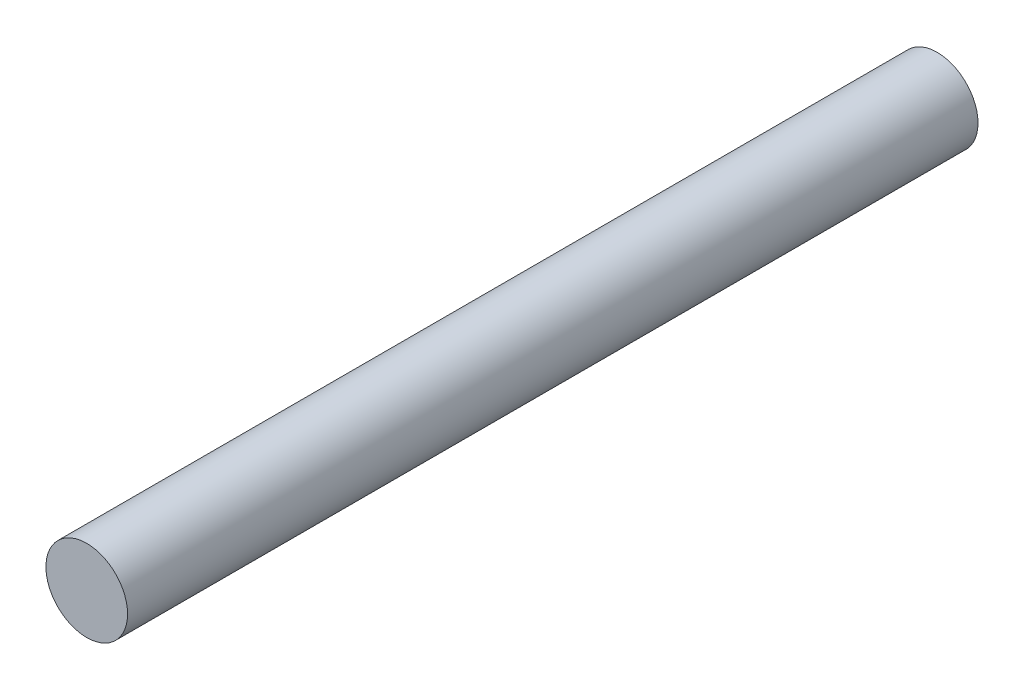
ISO-10303-21;
HEADER;
FILE_DESCRIPTION(('STEP AP214'),'2;1');
FILE_NAME('part.step','',(''),(''),'','','');
FILE_SCHEMA(('AUTOMOTIVE_DESIGN { 1 0 10303 214 1 1 1 1 }'));
ENDSEC;
DATA;
#1=APPLICATION_CONTEXT('core data for automotive mechanical design processes');
#2=APPLICATION_PROTOCOL_DEFINITION('international standard','automotive_design',2000,#1);
#3=PRODUCT_CONTEXT('',#1,'mechanical');
#4=PRODUCT('Part','Part','',(#3));
#5=PRODUCT_RELATED_PRODUCT_CATEGORY('part','',(#4));
#6=PRODUCT_DEFINITION_FORMATION('','',#4);
#7=PRODUCT_DEFINITION_CONTEXT('part definition',#1,'design');
#8=PRODUCT_DEFINITION('design','',#6,#7);
#9=PRODUCT_DEFINITION_SHAPE('','',#8);
#10=(LENGTH_UNIT() NAMED_UNIT(*) SI_UNIT(.MILLI.,.METRE.));
#11=(NAMED_UNIT(*) PLANE_ANGLE_UNIT() SI_UNIT($,.RADIAN.));
#12=(NAMED_UNIT(*) SI_UNIT($,.STERADIAN.) SOLID_ANGLE_UNIT());
#13=UNCERTAINTY_MEASURE_WITH_UNIT(LENGTH_MEASURE(1.E-05),#10,'distance_accuracy_value','');
#14=(GEOMETRIC_REPRESENTATION_CONTEXT(3) GLOBAL_UNCERTAINTY_ASSIGNED_CONTEXT((#13)) GLOBAL_UNIT_ASSIGNED_CONTEXT((#10,
#11,#12)) REPRESENTATION_CONTEXT('',''));
#15=CARTESIAN_POINT('',(0.,0.,0.));
#16=DIRECTION('',(0.,0.,1.));
#17=DIRECTION('',(1.,0.,0.));
#18=AXIS2_PLACEMENT_3D('',#15,#16,#17);
#19=CARTESIAN_POINT('',(0.,0.,250.));
#20=DIRECTION('',(0.,0.,1.));
#21=DIRECTION('',(1.,0.,0.));
#22=AXIS2_PLACEMENT_3D('',#19,#20,#21);
#23=PLANE('',#22);
#24=CARTESIAN_POINT('',(0.,0.,250.));
#25=DIRECTION('',(0.,0.,1.));
#26=DIRECTION('',(1.,0.,0.));
#27=AXIS2_PLACEMENT_3D('',#24,#25,#26);
#28=CIRCLE('',#27,12.);
#29=CARTESIAN_POINT('',(12.,0.,250.));
#30=VERTEX_POINT('',#29);
#31=EDGE_CURVE('E10',#30,#30,#28,.T.);
#32=ORIENTED_EDGE('',*,*,#31,.T.);
#33=EDGE_LOOP('',(#32));
#34=FACE_BOUND('',#33,.T.);
#35=ADVANCED_FACE('F16',(#34),#23,.T.);
#36=CARTESIAN_POINT('',(0.,0.,0.));
#37=DIRECTION('',(0.,0.,1.));
#38=DIRECTION('',(1.,0.,0.));
#39=AXIS2_PLACEMENT_3D('',#36,#37,#38);
#40=PLANE('',#39);
#41=CARTESIAN_POINT('',(0.,0.,0.));
#42=DIRECTION('',(0.,0.,1.));
#43=DIRECTION('',(1.,0.,0.));
#44=AXIS2_PLACEMENT_3D('',#41,#42,#43);
#45=CIRCLE('',#44,12.);
#46=CARTESIAN_POINT('',(12.,0.,0.));
#47=VERTEX_POINT('',#46);
#48=EDGE_CURVE('E41',#47,#47,#45,.T.);
#49=ORIENTED_EDGE('',*,*,#48,.F.);
#50=EDGE_LOOP('',(#49));
#51=FACE_BOUND('',#50,.T.);
#52=ADVANCED_FACE('F51',(#51),#40,.F.);
#53=CARTESIAN_POINT('',(0.,0.,0.));
#54=DIRECTION('',(0.,0.,-1.));
#55=DIRECTION('',(1.,0.,0.));
#56=AXIS2_PLACEMENT_3D('',#53,#54,#55);
#57=CYLINDRICAL_SURFACE('',#56,12.);
#58=ORIENTED_EDGE('',*,*,#48,.T.);
#59=DIRECTION('',(0.,0.,1.));
#60=VECTOR('',#59,1.);
#61=CARTESIAN_POINT('',(12.,0.,0.));
#62=LINE('',#61,#60);
#63=EDGE_CURVE('E24',#47,#30,#62,.T.);
#64=ORIENTED_EDGE('',*,*,#63,.T.);
#65=ORIENTED_EDGE('',*,*,#31,.F.);
#66=ORIENTED_EDGE('',*,*,#63,.F.);
#67=EDGE_LOOP('',(#58,#64,#65,#66));
#68=FACE_BOUND('',#67,.T.);
#69=ADVANCED_FACE('F39',(#68),#57,.T.);
#70=CLOSED_SHELL('',(#35,#52,#69));
#71=MANIFOLD_SOLID_BREP('B1',#70);
#72=ADVANCED_BREP_SHAPE_REPRESENTATION('',(#18,#71),#14);
#73=SHAPE_DEFINITION_REPRESENTATION(#9,#72);
ENDSEC;
END-ISO-10303-21;
